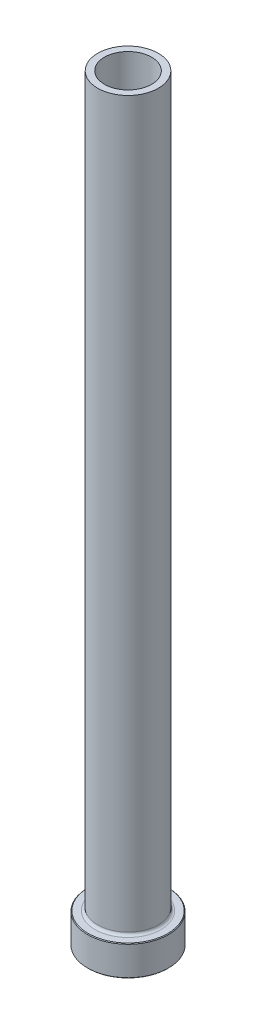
ISO-10303-21;
HEADER;
FILE_DESCRIPTION(('STEP AP214'),'2;1');
FILE_NAME('part.step','',(''),(''),'','','');
FILE_SCHEMA(('AUTOMOTIVE_DESIGN { 1 0 10303 214 1 1 1 1 }'));
ENDSEC;
DATA;
#1=APPLICATION_CONTEXT('core data for automotive mechanical design processes');
#2=APPLICATION_PROTOCOL_DEFINITION('international standard','automotive_design',2000,#1);
#3=PRODUCT_CONTEXT('',#1,'mechanical');
#4=PRODUCT('Part','Part','',(#3));
#5=PRODUCT_RELATED_PRODUCT_CATEGORY('part','',(#4));
#6=PRODUCT_DEFINITION_FORMATION('','',#4);
#7=PRODUCT_DEFINITION_CONTEXT('part definition',#1,'design');
#8=PRODUCT_DEFINITION('design','',#6,#7);
#9=PRODUCT_DEFINITION_SHAPE('','',#8);
#10=(LENGTH_UNIT() NAMED_UNIT(*) SI_UNIT(.MILLI.,.METRE.));
#11=(NAMED_UNIT(*) PLANE_ANGLE_UNIT() SI_UNIT($,.RADIAN.));
#12=(NAMED_UNIT(*) SI_UNIT($,.STERADIAN.) SOLID_ANGLE_UNIT());
#13=UNCERTAINTY_MEASURE_WITH_UNIT(LENGTH_MEASURE(1.E-05),#10,'distance_accuracy_value','');
#14=(GEOMETRIC_REPRESENTATION_CONTEXT(3) GLOBAL_UNCERTAINTY_ASSIGNED_CONTEXT((#13)) GLOBAL_UNIT_ASSIGNED_CONTEXT((#10,
#11,#12)) REPRESENTATION_CONTEXT('',''));
#15=CARTESIAN_POINT('',(0.,0.,0.));
#16=DIRECTION('',(0.,0.,1.));
#17=DIRECTION('',(1.,0.,0.));
#18=AXIS2_PLACEMENT_3D('',#15,#16,#17);
#19=CARTESIAN_POINT('',(0.,92.1876809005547,0.));
#20=DIRECTION('',(0.,1.,0.));
#21=DIRECTION('',(0.,0.,1.));
#22=AXIS2_PLACEMENT_3D('',#19,#20,#21);
#23=CYLINDRICAL_SURFACE('',#22,7.00000000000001);
#24=CARTESIAN_POINT('',(0.,225.,0.));
#25=DIRECTION('',(0.,1.,0.));
#26=DIRECTION('',(0.,0.,1.));
#27=AXIS2_PLACEMENT_3D('',#24,#25,#26);
#28=CIRCLE('',#27,7.00000000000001);
#29=CARTESIAN_POINT('',(0.,225.,7.00000000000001));
#30=VERTEX_POINT('',#29);
#31=EDGE_CURVE('E62',#30,#30,#28,.T.);
#32=ORIENTED_EDGE('',*,*,#31,.T.);
#33=EDGE_LOOP('',(#32));
#34=FACE_BOUND('',#33,.T.);
#35=CARTESIAN_POINT('',(0.,170.,0.));
#36=DIRECTION('',(0.,1.,0.));
#37=DIRECTION('',(0.,0.,1.));
#38=AXIS2_PLACEMENT_3D('',#35,#36,#37);
#39=CIRCLE('',#38,7.00000000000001);
#40=CARTESIAN_POINT('',(0.,170.,7.00000000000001));
#41=VERTEX_POINT('',#40);
#42=EDGE_CURVE('E71',#41,#41,#39,.T.);
#43=ORIENTED_EDGE('',*,*,#42,.F.);
#44=EDGE_LOOP('',(#43));
#45=FACE_BOUND('',#44,.T.);
#46=ADVANCED_FACE('F30',(#34,#45),#23,.F.);
#47=CARTESIAN_POINT('',(-7.00000000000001,225.,0.));
#48=DIRECTION('',(0.,1.,0.));
#49=DIRECTION('',(0.,0.,1.));
#50=AXIS2_PLACEMENT_3D('',#47,#48,#49);
#51=PLANE('',#50);
#52=CARTESIAN_POINT('',(0.,225.,0.));
#53=DIRECTION('',(0.,1.,0.));
#54=DIRECTION('',(0.,0.,1.));
#55=AXIS2_PLACEMENT_3D('',#52,#53,#54);
#56=CIRCLE('',#55,9.00000000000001);
#57=CARTESIAN_POINT('',(0.,225.,9.00000000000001));
#58=VERTEX_POINT('',#57);
#59=EDGE_CURVE('E65',#58,#58,#56,.T.);
#60=ORIENTED_EDGE('',*,*,#59,.T.);
#61=EDGE_LOOP('',(#60));
#62=FACE_BOUND('',#61,.T.);
#63=ORIENTED_EDGE('',*,*,#31,.F.);
#64=EDGE_LOOP('',(#63));
#65=FACE_BOUND('',#64,.T.);
#66=ADVANCED_FACE('F79',(#62,#65),#51,.T.);
#67=CARTESIAN_POINT('',(0.,92.1876809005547,0.));
#68=DIRECTION('',(0.,1.,0.));
#69=DIRECTION('',(0.,0.,1.));
#70=AXIS2_PLACEMENT_3D('',#67,#68,#69);
#71=CYLINDRICAL_SURFACE('',#70,9.);
#72=CARTESIAN_POINT('',(0.,9.8,0.));
#73=DIRECTION('',(0.,1.,0.));
#74=DIRECTION('',(0.,0.,1.));
#75=AXIS2_PLACEMENT_3D('',#72,#73,#74);
#76=CIRCLE('',#75,9.);
#77=CARTESIAN_POINT('',(0.,9.8,9.));
#78=VERTEX_POINT('',#77);
#79=EDGE_CURVE('E59',#78,#78,#76,.T.);
#80=ORIENTED_EDGE('',*,*,#79,.T.);
#81=EDGE_LOOP('',(#80));
#82=FACE_BOUND('',#81,.T.);
#83=ORIENTED_EDGE('',*,*,#59,.F.);
#84=EDGE_LOOP('',(#83));
#85=FACE_BOUND('',#84,.T.);
#86=ADVANCED_FACE('F85',(#82,#85),#71,.T.);
#87=CARTESIAN_POINT('',(-8.99999999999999,9.,0.));
#88=DIRECTION('',(0.,1.,0.));
#89=DIRECTION('',(0.,0.,1.));
#90=AXIS2_PLACEMENT_3D('',#87,#88,#89);
#91=PLANE('',#90);
#92=CARTESIAN_POINT('',(0.,9.,0.));
#93=DIRECTION('',(0.,1.,0.));
#94=DIRECTION('',(0.,0.,1.));
#95=AXIS2_PLACEMENT_3D('',#92,#93,#94);
#96=CIRCLE('',#95,11.8);
#97=CARTESIAN_POINT('',(0.,9.,-11.8));
#98=VERTEX_POINT('',#97);
#99=EDGE_CURVE('E53',#98,#98,#96,.T.);
#100=ORIENTED_EDGE('',*,*,#99,.T.);
#101=EDGE_LOOP('',(#100));
#102=FACE_BOUND('',#101,.T.);
#103=CARTESIAN_POINT('',(0.,9.,0.));
#104=DIRECTION('',(0.,1.,0.));
#105=DIRECTION('',(0.,0.,1.));
#106=AXIS2_PLACEMENT_3D('',#103,#104,#105);
#107=CIRCLE('',#106,9.8);
#108=CARTESIAN_POINT('',(0.,9.,9.8));
#109=VERTEX_POINT('',#108);
#110=EDGE_CURVE('E56',#109,#109,#107,.F.);
#111=ORIENTED_EDGE('',*,*,#110,.T.);
#112=EDGE_LOOP('',(#111));
#113=FACE_BOUND('',#112,.T.);
#114=ADVANCED_FACE('F111',(#102,#113),#91,.T.);
#115=CARTESIAN_POINT('',(0.,92.1876809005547,0.));
#116=DIRECTION('',(0.,1.,0.));
#117=DIRECTION('',(0.,0.,1.));
#118=AXIS2_PLACEMENT_3D('',#115,#116,#117);
#119=CYLINDRICAL_SURFACE('',#118,12.);
#120=CARTESIAN_POINT('',(0.,8.80000000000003,0.));
#121=DIRECTION('',(0.,1.,0.));
#122=DIRECTION('',(0.,0.,1.));
#123=AXIS2_PLACEMENT_3D('',#120,#121,#122);
#124=CIRCLE('',#123,12.);
#125=CARTESIAN_POINT('',(0.,8.80000000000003,-12.));
#126=VERTEX_POINT('',#125);
#127=EDGE_CURVE('E45',#126,#126,#124,.F.);
#128=ORIENTED_EDGE('',*,*,#127,.T.);
#129=EDGE_LOOP('',(#128));
#130=FACE_BOUND('',#129,.T.);
#131=CARTESIAN_POINT('',(0.,0.200000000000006,0.));
#132=DIRECTION('',(0.,-1.,0.));
#133=DIRECTION('',(0.,0.,-1.));
#134=AXIS2_PLACEMENT_3D('',#131,#132,#133);
#135=CIRCLE('',#134,12.);
#136=CARTESIAN_POINT('',(0.,0.200000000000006,-12.));
#137=VERTEX_POINT('',#136);
#138=EDGE_CURVE('E50',#137,#137,#135,.F.);
#139=ORIENTED_EDGE('',*,*,#138,.T.);
#140=EDGE_LOOP('',(#139));
#141=FACE_BOUND('',#140,.T.);
#142=ADVANCED_FACE('F108',(#130,#141),#119,.T.);
#143=CARTESIAN_POINT('',(-12.,0.,0.));
#144=DIRECTION('',(0.,-1.,0.));
#145=DIRECTION('',(0.,0.,-1.));
#146=AXIS2_PLACEMENT_3D('',#143,#144,#145);
#147=PLANE('',#146);
#148=CARTESIAN_POINT('',(0.,0.,0.));
#149=DIRECTION('',(0.,-1.,0.));
#150=DIRECTION('',(0.,0.,-1.));
#151=AXIS2_PLACEMENT_3D('',#148,#149,#150);
#152=CIRCLE('',#151,7.74999999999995);
#153=CARTESIAN_POINT('',(0.,0.,-7.74999999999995));
#154=VERTEX_POINT('',#153);
#155=EDGE_CURVE('E37',#154,#154,#152,.F.);
#156=ORIENTED_EDGE('',*,*,#155,.T.);
#157=EDGE_LOOP('',(#156));
#158=FACE_BOUND('',#157,.T.);
#159=CARTESIAN_POINT('',(0.,0.,0.));
#160=DIRECTION('',(0.,-1.,0.));
#161=DIRECTION('',(0.,0.,-1.));
#162=AXIS2_PLACEMENT_3D('',#159,#160,#161);
#163=CIRCLE('',#162,11.8);
#164=CARTESIAN_POINT('',(0.,0.,-11.8));
#165=VERTEX_POINT('',#164);
#166=EDGE_CURVE('E41',#165,#165,#163,.T.);
#167=ORIENTED_EDGE('',*,*,#166,.T.);
#168=EDGE_LOOP('',(#167));
#169=FACE_BOUND('',#168,.T.);
#170=ADVANCED_FACE('F110',(#158,#169),#147,.T.);
#171=CARTESIAN_POINT('',(0.,92.1876809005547,0.));
#172=DIRECTION('',(0.,1.,0.));
#173=DIRECTION('',(0.,0.,1.));
#174=AXIS2_PLACEMENT_3D('',#171,#172,#173);
#175=CYLINDRICAL_SURFACE('',#174,7.25);
#176=CARTESIAN_POINT('',(0.,0.499999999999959,0.));
#177=DIRECTION('',(0.,-1.,0.));
#178=DIRECTION('',(0.,0.,-1.));
#179=AXIS2_PLACEMENT_3D('',#176,#177,#178);
#180=CIRCLE('',#179,7.25);
#181=CARTESIAN_POINT('',(0.,0.499999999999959,-7.25));
#182=VERTEX_POINT('',#181);
#183=EDGE_CURVE('E10',#182,#182,#180,.T.);
#184=ORIENTED_EDGE('',*,*,#183,.T.);
#185=EDGE_LOOP('',(#184));
#186=FACE_BOUND('',#185,.T.);
#187=CARTESIAN_POINT('',(0.,158.,0.));
#188=DIRECTION('',(0.,1.,0.));
#189=DIRECTION('',(0.,0.,1.));
#190=AXIS2_PLACEMENT_3D('',#187,#188,#189);
#191=CIRCLE('',#190,7.25000000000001);
#192=CARTESIAN_POINT('',(0.,158.,7.25000000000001));
#193=VERTEX_POINT('',#192);
#194=EDGE_CURVE('E68',#193,#193,#191,.T.);
#195=ORIENTED_EDGE('',*,*,#194,.T.);
#196=EDGE_LOOP('',(#195));
#197=FACE_BOUND('',#196,.T.);
#198=ADVANCED_FACE('F118',(#186,#197),#175,.F.);
#199=CARTESIAN_POINT('',(0.,158.,0.));
#200=DIRECTION('',(0.,-1.,0.));
#201=DIRECTION('',(0.,0.,-1.));
#202=AXIS2_PLACEMENT_3D('',#199,#200,#201);
#203=CONICAL_SURFACE('',#202,7.25000000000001,0.0208303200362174);
#204=ORIENTED_EDGE('',*,*,#42,.T.);
#205=EDGE_LOOP('',(#204));
#206=FACE_BOUND('',#205,.T.);
#207=ORIENTED_EDGE('',*,*,#194,.F.);
#208=EDGE_LOOP('',(#207));
#209=FACE_BOUND('',#208,.T.);
#210=ADVANCED_FACE('F75',(#206,#209),#203,.F.);
#211=CARTESIAN_POINT('',(0.,9.8,0.));
#212=DIRECTION('',(0.,1.,0.));
#213=DIRECTION('',(0.,0.,1.));
#214=AXIS2_PLACEMENT_3D('',#211,#212,#213);
#215=TOROIDAL_SURFACE('',#214,9.8,0.8);
#216=ORIENTED_EDGE('',*,*,#110,.F.);
#217=EDGE_LOOP('',(#216));
#218=FACE_BOUND('',#217,.T.);
#219=ORIENTED_EDGE('',*,*,#79,.F.);
#220=EDGE_LOOP('',(#219));
#221=FACE_BOUND('',#220,.T.);
#222=ADVANCED_FACE('F90',(#218,#221),#215,.F.);
#223=CARTESIAN_POINT('',(0.,9.00000000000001,0.));
#224=DIRECTION('',(0.,-1.,0.));
#225=DIRECTION('',(0.,0.,-1.));
#226=AXIS2_PLACEMENT_3D('',#223,#224,#225);
#227=CONICAL_SURFACE('',#226,11.8,0.785398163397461);
#228=CARTESIAN_POINT('',(0.,8.80000000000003,-12.));
#229=CARTESIAN_POINT('',(0.,8.80208333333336,-11.9979166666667));
#230=CARTESIAN_POINT('',(0.,8.80416666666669,-11.9958333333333));
#231=CARTESIAN_POINT('',(0.,8.80833333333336,-11.9916666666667));
#232=CARTESIAN_POINT('',(0.,8.81041666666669,-11.9895833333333));
#233=CARTESIAN_POINT('',(0.,8.81458333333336,-11.9854166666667));
#234=CARTESIAN_POINT('',(0.,8.81666666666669,-11.9833333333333));
#235=CARTESIAN_POINT('',(0.,8.82083333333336,-11.9791666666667));
#236=CARTESIAN_POINT('',(0.,8.82291666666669,-11.9770833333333));
#237=CARTESIAN_POINT('',(0.,8.82708333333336,-11.9729166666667));
#238=CARTESIAN_POINT('',(0.,8.82916666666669,-11.9708333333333));
#239=CARTESIAN_POINT('',(0.,8.83333333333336,-11.9666666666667));
#240=CARTESIAN_POINT('',(0.,8.83541666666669,-11.9645833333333));
#241=CARTESIAN_POINT('',(0.,8.83958333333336,-11.9604166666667));
#242=CARTESIAN_POINT('',(0.,8.84166666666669,-11.9583333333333));
#243=CARTESIAN_POINT('',(0.,8.84583333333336,-11.9541666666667));
#244=CARTESIAN_POINT('',(0.,8.84791666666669,-11.9520833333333));
#245=CARTESIAN_POINT('',(0.,8.85208333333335,-11.9479166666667));
#246=CARTESIAN_POINT('',(0.,8.85416666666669,-11.9458333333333));
#247=CARTESIAN_POINT('',(0.,8.85833333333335,-11.9416666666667));
#248=CARTESIAN_POINT('',(0.,8.86041666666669,-11.9395833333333));
#249=CARTESIAN_POINT('',(0.,8.86458333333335,-11.9354166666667));
#250=CARTESIAN_POINT('',(0.,8.86666666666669,-11.9333333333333));
#251=CARTESIAN_POINT('',(0.,8.87083333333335,-11.9291666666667));
#252=CARTESIAN_POINT('',(0.,8.87291666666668,-11.9270833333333));
#253=CARTESIAN_POINT('',(0.,8.87708333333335,-11.9229166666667));
#254=CARTESIAN_POINT('',(0.,8.87916666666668,-11.9208333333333));
#255=CARTESIAN_POINT('',(0.,8.88333333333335,-11.9166666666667));
#256=CARTESIAN_POINT('',(0.,8.88541666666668,-11.9145833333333));
#257=CARTESIAN_POINT('',(0.,8.88958333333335,-11.9104166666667));
#258=CARTESIAN_POINT('',(0.,8.89166666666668,-11.9083333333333));
#259=CARTESIAN_POINT('',(0.,8.89583333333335,-11.9041666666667));
#260=CARTESIAN_POINT('',(0.,8.89791666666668,-11.9020833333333));
#261=CARTESIAN_POINT('',(0.,8.90208333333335,-11.8979166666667));
#262=CARTESIAN_POINT('',(0.,8.90416666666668,-11.8958333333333));
#263=CARTESIAN_POINT('',(0.,8.90833333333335,-11.8916666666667));
#264=CARTESIAN_POINT('',(0.,8.91041666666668,-11.8895833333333));
#265=CARTESIAN_POINT('',(0.,8.91458333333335,-11.8854166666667));
#266=CARTESIAN_POINT('',(0.,8.91666666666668,-11.8833333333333));
#267=CARTESIAN_POINT('',(0.,8.92083333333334,-11.8791666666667));
#268=CARTESIAN_POINT('',(0.,8.92291666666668,-11.8770833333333));
#269=CARTESIAN_POINT('',(0.,8.92708333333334,-11.8729166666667));
#270=CARTESIAN_POINT('',(0.,8.92916666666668,-11.8708333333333));
#271=CARTESIAN_POINT('',(0.,8.93333333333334,-11.8666666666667));
#272=CARTESIAN_POINT('',(0.,8.93541666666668,-11.8645833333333));
#273=CARTESIAN_POINT('',(0.,8.93958333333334,-11.8604166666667));
#274=CARTESIAN_POINT('',(0.,8.94166666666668,-11.8583333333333));
#275=CARTESIAN_POINT('',(0.,8.94583333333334,-11.8541666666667));
#276=CARTESIAN_POINT('',(0.,8.94791666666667,-11.8520833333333));
#277=CARTESIAN_POINT('',(0.,8.95208333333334,-11.8479166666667));
#278=CARTESIAN_POINT('',(0.,8.95416666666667,-11.8458333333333));
#279=CARTESIAN_POINT('',(0.,8.95833333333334,-11.8416666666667));
#280=CARTESIAN_POINT('',(0.,8.96041666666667,-11.8395833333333));
#281=CARTESIAN_POINT('',(0.,8.96458333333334,-11.8354166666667));
#282=CARTESIAN_POINT('',(0.,8.96666666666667,-11.8333333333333));
#283=CARTESIAN_POINT('',(0.,8.97083333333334,-11.8291666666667));
#284=CARTESIAN_POINT('',(0.,8.97291666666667,-11.8270833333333));
#285=CARTESIAN_POINT('',(0.,8.97708333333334,-11.8229166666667));
#286=CARTESIAN_POINT('',(0.,8.97916666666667,-11.8208333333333));
#287=CARTESIAN_POINT('',(0.,8.98333333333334,-11.8166666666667));
#288=CARTESIAN_POINT('',(0.,8.98541666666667,-11.8145833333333));
#289=CARTESIAN_POINT('',(0.,8.98958333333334,-11.8104166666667));
#290=CARTESIAN_POINT('',(0.,8.99166666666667,-11.8083333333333));
#291=CARTESIAN_POINT('',(0.,8.99583333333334,-11.8041666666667));
#292=CARTESIAN_POINT('',(0.,8.99791666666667,-11.8020833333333));
#293=CARTESIAN_POINT('',(0.,9.,-11.8));
#294=B_SPLINE_CURVE_WITH_KNOTS('',3,(#228,#229,#230,#231,#232,#233,#234,#235,#236,#237,#238,
#239,#240,#241,#242,#243,#244,#245,#246,#247,#248,#249,#250,#251,#252,#253,#254,#255,#256,#257,
#258,#259,#260,#261,#262,#263,#264,#265,#266,#267,#268,#269,#270,#271,#272,#273,#274,#275,#276,
#277,#278,#279,#280,#281,#282,#283,#284,#285,#286,#287,#288,#289,#290,#291,#292,#293),
.UNSPECIFIED.,.F.,.F.,(4,2,2,2,2,2,2,2,2,2,2,2,2,2,2,2,2,2,2,2,2,2,2,2,2,2,2,2,2,2,2,2,4),(0.,
0.00883883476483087,0.0176776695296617,0.0265165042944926,0.0353553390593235,0.0441941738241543,
0.0530330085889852,0.0618718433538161,0.0707106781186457,0.0795495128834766,0.0883883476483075,
0.0972271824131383,0.106066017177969,0.1149048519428,0.123743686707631,0.132582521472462,
0.141421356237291,0.150260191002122,0.159099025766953,0.167937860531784,0.176776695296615,
0.185615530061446,0.194454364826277,0.203293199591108,0.212132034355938,0.220970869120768,
0.229809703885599,0.23864853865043,0.247487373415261,0.256326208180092,0.265165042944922,
0.274003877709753,0.282842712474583),.UNSPECIFIED.);
#295=EDGE_CURVE('BSEAM93',#126,#98,#294,.T.);
#296=ORIENTED_EDGE('',*,*,#127,.F.);
#297=ORIENTED_EDGE('',*,*,#99,.F.);
#298=ORIENTED_EDGE('',*,*,#295,.T.);
#299=ORIENTED_EDGE('',*,*,#295,.F.);
#300=EDGE_LOOP('',(#296,#298,#297,#299));
#301=FACE_BOUND('',#300,.T.);
#302=ADVANCED_FACE('F93',(#301),#227,.T.);
#303=CARTESIAN_POINT('',(0.,0.200000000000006,0.));
#304=DIRECTION('',(0.,1.,0.));
#305=DIRECTION('',(0.,0.,1.));
#306=AXIS2_PLACEMENT_3D('',#303,#304,#305);
#307=CONICAL_SURFACE('',#306,12.,0.785398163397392);
#308=ORIENTED_EDGE('',*,*,#166,.F.);
#309=EDGE_LOOP('',(#308));
#310=FACE_BOUND('',#309,.T.);
#311=ORIENTED_EDGE('',*,*,#138,.F.);
#312=EDGE_LOOP('',(#311));
#313=FACE_BOUND('',#312,.T.);
#314=ADVANCED_FACE('F96',(#310,#313),#307,.T.);
#315=CARTESIAN_POINT('',(0.,0.,0.));
#316=DIRECTION('',(0.,-1.,0.));
#317=DIRECTION('',(0.,0.,-1.));
#318=AXIS2_PLACEMENT_3D('',#315,#316,#317);
#319=CONICAL_SURFACE('',#318,7.74999999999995,0.785398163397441);
#320=ORIENTED_EDGE('',*,*,#183,.F.);
#321=EDGE_LOOP('',(#320));
#322=FACE_BOUND('',#321,.T.);
#323=ORIENTED_EDGE('',*,*,#155,.F.);
#324=EDGE_LOOP('',(#323));
#325=FACE_BOUND('',#324,.T.);
#326=ADVANCED_FACE('F32',(#322,#325),#319,.F.);
#327=CLOSED_SHELL('',(#46,#66,#86,#114,#142,#170,#198,#210,#222,#302,#314,#326));
#328=MANIFOLD_SOLID_BREP('B2',#327);
#329=ADVANCED_BREP_SHAPE_REPRESENTATION('',(#18,#328),#14);
#330=SHAPE_DEFINITION_REPRESENTATION(#9,#329);
ENDSEC;
END-ISO-10303-21;
